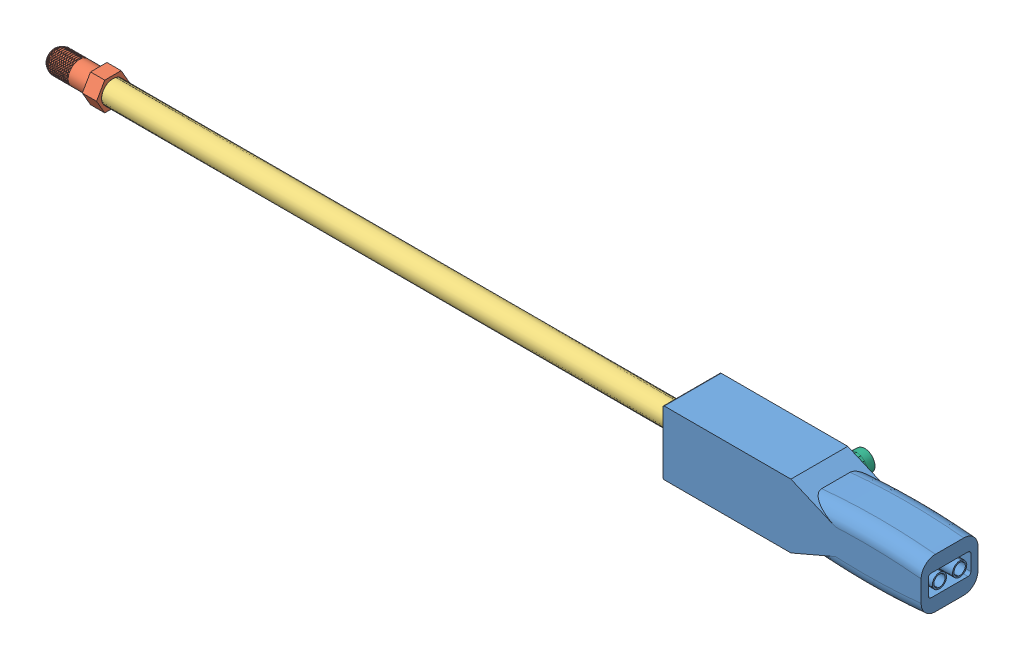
SolidWorks assembly Ensamblaje1.sldasm, configuration Predeterminado (file format 11000). Lengths in mm.
Overall size (629.74 45 52.27).
6 component instances, 6 part files, 9 mates.
Components (placement in the parent):
- modulo-1: modulo.SLDPRT [Predeterminado] at (227.1942 30 17.8888) x (-1 0 0) z (0 0 -1) size (195.64 45 46.54)
- pincha-1: pincha.SLDPRT [Predeterminado] at (-224.8058 30 2.8888) x (0 0 1) z (-1 0 0) size (23.09 20 41.1)
- tuvo de pichan-1: tuvo de pichan.SLDPRT [Predeterminado] at (-224.8058 30 2.8888) x (0 0 -1) z (1 0 0) size (16 16 400)
- Lampara Indicadora 2-2: Lampara Indicadora 2.SLDPRT [Predeterminado] at (275.1942 19 -20.1112) x (-1 0 0) z (0 0 -1) size (16 16 29)
- LCD3-2: LCD3.SLDPRT [Predeterminado] at (227.1942 30 -12.1112) x (-1 0 0) z (0 0 -1) size (78 33 6)
- Lampara Indicadora-3: Lampara Indicadora.SLDPRT [Predeterminado] at (275.1942 41 -20.1112) x (1 0 0) z (0 0 -1) size (16 16 29)
Mates (geometry in assembly coordinates):
- Coincidente1: coincident: circle of assembly; circle of assembly; circle of modulo-1; circle of tuvo de pichan-1
- Concéntrica1: concentric: cylinder of assembly; cylinder of assembly; cylinder of pincha-1 through (-234.8058 30 2.8888) axis (1 0 0) radius 8; cylinder of tuvo de pichan-1 through (175.1942 30 2.8888) axis (-1 0 0) radius 8
- Concéntrica2: concentric: cylinder of assembly; cylinder of assembly; cylinder of modulo-1 through (275.1942 19 12.8888) axis (0 0 -1) radius 6; cylinder of Lampara Indicadora 2-2 through (275.1942 19 2.8888) axis (0 0 -1) radius 6
- Coincidente2: coincident: circle of assembly; plane of assembly; plane of modulo-1; plane of Lampara Indicadora 2-2 through (275.1942 19 -17.1112) normal (0 0 1)
- Concéntrica3: concentric: cylinder of assembly; cylinder of assembly; cylinder of modulo-1 through (275.1942 41 12.8888) axis (0 0 -1) radius 6; cylinder of Lampara Indicadora-3 through (275.1942 41 2.8888) axis (0 0 -1) radius 6
- Coincidente3: coincident: circle of assembly; circle of assembly; circle of modulo-1; circle of Lampara Indicadora-3
- Coincidente5: coincident: line of modulo-1 through (262.1942 42 -17.1112) axis (-1 0 0); plane of ? through (221.2508 30 -17.1112) normal (0 0 1)
- Coincidente6: coincident: plane of modulo-1 through (227.1942 18 -17.1112) normal (0 1 0); plane of ? through (256.2508 18 -17.1112) normal (0 -1 0)
- Coincidente7: coincident: plane of assembly; plane of assembly; plane of modulo-1 through (262.1942 30 -17.1112) normal (-1 0 0); plane of LCD3-2 through (262.1942 42 -17.1112) normal (1 0 0)
